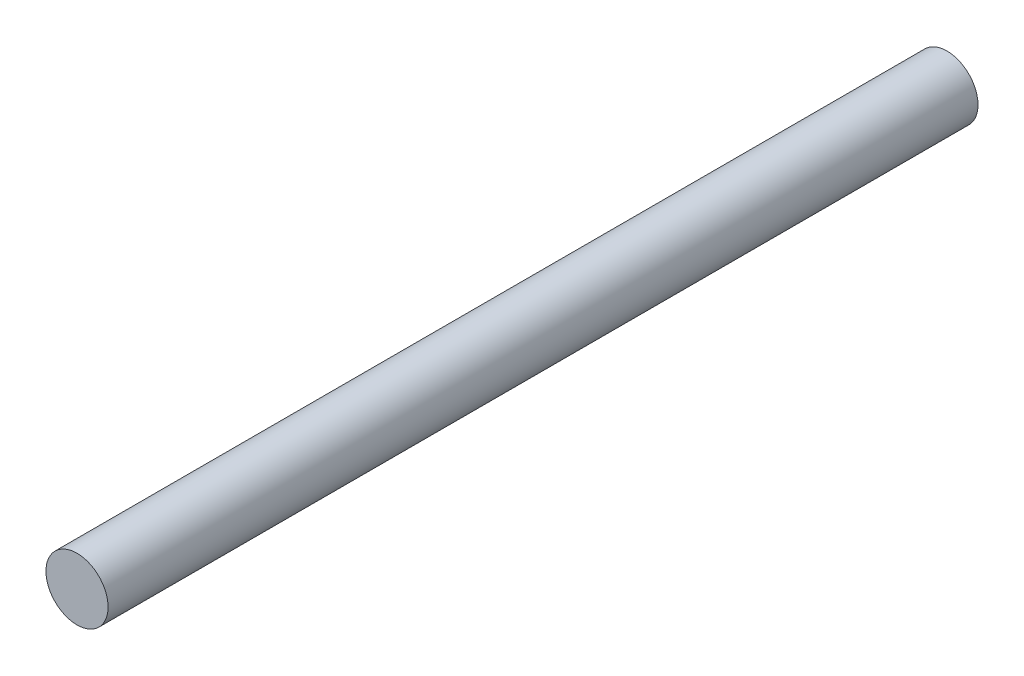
ISO-10303-21;
HEADER;
FILE_DESCRIPTION(('STEP AP214'),'2;1');
FILE_NAME('part.step','',(''),(''),'','','');
FILE_SCHEMA(('AUTOMOTIVE_DESIGN { 1 0 10303 214 1 1 1 1 }'));
ENDSEC;
DATA;
#1=APPLICATION_CONTEXT('core data for automotive mechanical design processes');
#2=APPLICATION_PROTOCOL_DEFINITION('international standard','automotive_design',2000,#1);
#3=PRODUCT_CONTEXT('',#1,'mechanical');
#4=PRODUCT('Part','Part','',(#3));
#5=PRODUCT_RELATED_PRODUCT_CATEGORY('part','',(#4));
#6=PRODUCT_DEFINITION_FORMATION('','',#4);
#7=PRODUCT_DEFINITION_CONTEXT('part definition',#1,'design');
#8=PRODUCT_DEFINITION('design','',#6,#7);
#9=PRODUCT_DEFINITION_SHAPE('','',#8);
#10=(LENGTH_UNIT() NAMED_UNIT(*) SI_UNIT(.MILLI.,.METRE.));
#11=(NAMED_UNIT(*) PLANE_ANGLE_UNIT() SI_UNIT($,.RADIAN.));
#12=(NAMED_UNIT(*) SI_UNIT($,.STERADIAN.) SOLID_ANGLE_UNIT());
#13=UNCERTAINTY_MEASURE_WITH_UNIT(LENGTH_MEASURE(1.E-05),#10,'distance_accuracy_value','');
#14=(GEOMETRIC_REPRESENTATION_CONTEXT(3) GLOBAL_UNCERTAINTY_ASSIGNED_CONTEXT((#13)) GLOBAL_UNIT_ASSIGNED_CONTEXT((#10,
#11,#12)) REPRESENTATION_CONTEXT('',''));
#15=CARTESIAN_POINT('',(0.,0.,0.));
#16=DIRECTION('',(0.,0.,1.));
#17=DIRECTION('',(1.,0.,0.));
#18=AXIS2_PLACEMENT_3D('',#15,#16,#17);
#19=CARTESIAN_POINT('',(0.,0.,177.8));
#20=DIRECTION('',(0.,0.,-1.));
#21=DIRECTION('',(-1.,0.,0.));
#22=AXIS2_PLACEMENT_3D('',#19,#20,#21);
#23=CYLINDRICAL_SURFACE('',#22,6.35);
#24=CARTESIAN_POINT('',(0.,0.,177.8));
#25=DIRECTION('',(0.,0.,1.));
#26=DIRECTION('',(1.,0.,0.));
#27=AXIS2_PLACEMENT_3D('',#24,#25,#26);
#28=CIRCLE('',#27,6.35);
#29=CARTESIAN_POINT('',(6.35,0.,177.8));
#30=VERTEX_POINT('',#29);
#31=EDGE_CURVE('E10',#30,#30,#28,.T.);
#32=ORIENTED_EDGE('',*,*,#31,.F.);
#33=EDGE_LOOP('',(#32));
#34=FACE_BOUND('',#33,.T.);
#35=CARTESIAN_POINT('',(0.,0.,0.));
#36=DIRECTION('',(0.,0.,1.));
#37=DIRECTION('',(1.,0.,0.));
#38=AXIS2_PLACEMENT_3D('',#35,#36,#37);
#39=CIRCLE('',#38,6.35);
#40=CARTESIAN_POINT('',(6.35,0.,0.));
#41=VERTEX_POINT('',#40);
#42=EDGE_CURVE('E34',#41,#41,#39,.T.);
#43=ORIENTED_EDGE('',*,*,#42,.T.);
#44=EDGE_LOOP('',(#43));
#45=FACE_BOUND('',#44,.T.);
#46=ADVANCED_FACE('F31',(#34,#45),#23,.T.);
#47=CARTESIAN_POINT('',(0.,0.,177.8));
#48=DIRECTION('',(0.,0.,1.));
#49=DIRECTION('',(1.,0.,0.));
#50=AXIS2_PLACEMENT_3D('',#47,#48,#49);
#51=PLANE('',#50);
#52=ORIENTED_EDGE('',*,*,#31,.T.);
#53=EDGE_LOOP('',(#52));
#54=FACE_BOUND('',#53,.T.);
#55=ADVANCED_FACE('F46',(#54),#51,.T.);
#56=CARTESIAN_POINT('',(0.,0.,0.));
#57=DIRECTION('',(0.,0.,1.));
#58=DIRECTION('',(1.,0.,0.));
#59=AXIS2_PLACEMENT_3D('',#56,#57,#58);
#60=PLANE('',#59);
#61=ORIENTED_EDGE('',*,*,#42,.F.);
#62=EDGE_LOOP('',(#61));
#63=FACE_BOUND('',#62,.T.);
#64=ADVANCED_FACE('F44',(#63),#60,.F.);
#65=CLOSED_SHELL('',(#46,#55,#64));
#66=MANIFOLD_SOLID_BREP('B2',#65);
#67=ADVANCED_BREP_SHAPE_REPRESENTATION('',(#18,#66),#14);
#68=SHAPE_DEFINITION_REPRESENTATION(#9,#67);
ENDSEC;
END-ISO-10303-21;
